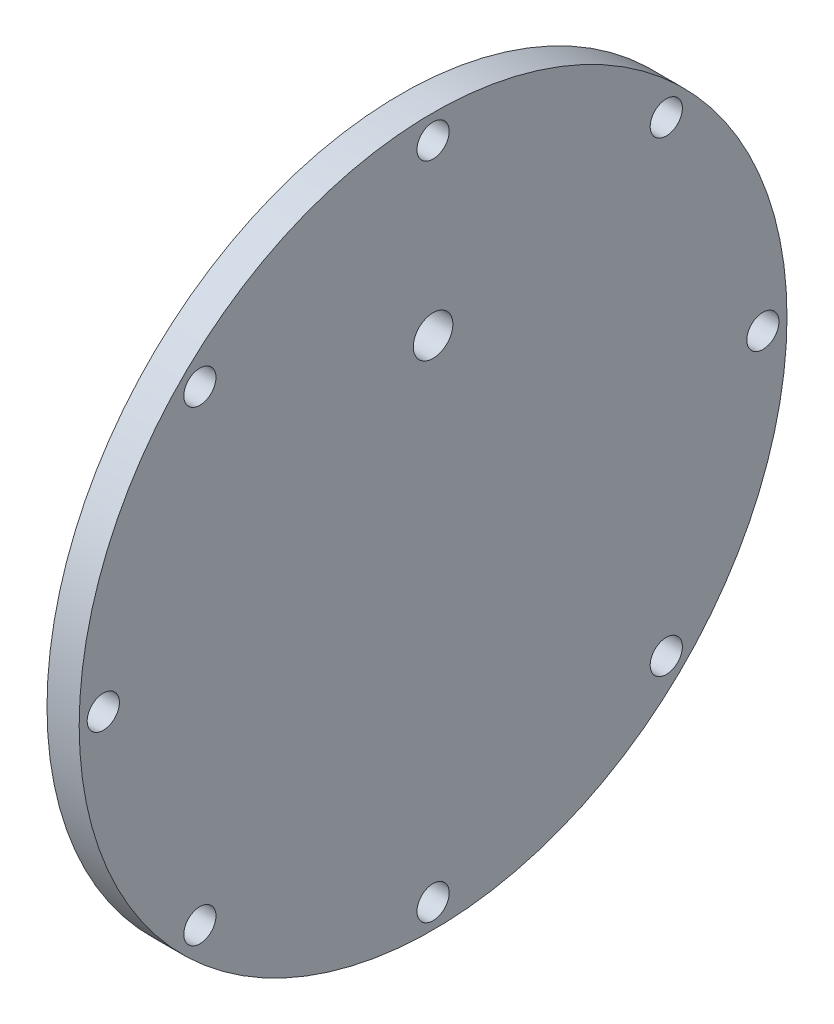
from build123d import *

# Parameters (mm, degrees)
SKETCH1_R           = 69.85
SKETCH1_R_2         = 3.175
BOSS_EXTRUDE1_DEPTH = 6.35
SKETCH2_R           = 3.90271
CUT_EXTRUDE1_DEPTH  = 6.35


with BuildPart() as part:
    # Sketch1 → Boss-Extrude1 (new body)
    with BuildSketch(Plane(origin=(0, 0, 0), x_dir=(0, 0, -1), z_dir=(1, 0, 0))):
        Circle(SKETCH1_R)
        with Locations((0, 65.0875)):
            Circle(SKETCH1_R_2, mode=Mode.SUBTRACT)
        with Locations((46.02381262, 46.02381262)):
            Circle(SKETCH1_R_2, mode=Mode.SUBTRACT)
        with Locations((65.0875, 0)):
            Circle(SKETCH1_R_2, mode=Mode.SUBTRACT)
        with Locations((46.02381262, -46.02381262)):
            Circle(SKETCH1_R_2, mode=Mode.SUBTRACT)
        with Locations((0, -65.0875)):
            Circle(SKETCH1_R_2, mode=Mode.SUBTRACT)
        with Locations((-46.02381262, -46.02381262)):
            Circle(SKETCH1_R_2, mode=Mode.SUBTRACT)
        with Locations((-65.0875, 0)):
            Circle(SKETCH1_R_2, mode=Mode.SUBTRACT)
        with Locations((-46.02381262, 46.02381262)):
            Circle(SKETCH1_R_2, mode=Mode.SUBTRACT)
    extrude(amount=BOSS_EXTRUDE1_DEPTH)

    # Sketch2 → Cut-Extrude1 (cut)
    with BuildSketch(Plane(origin=(6.35, 0, 0), x_dir=(0, 0, -1), z_dir=(1, 0, 0))):
        with Locations((0, 31.75)):
            Circle(SKETCH2_R)
    extrude(amount=-CUT_EXTRUDE1_DEPTH, mode=Mode.SUBTRACT)


solid = part.part
